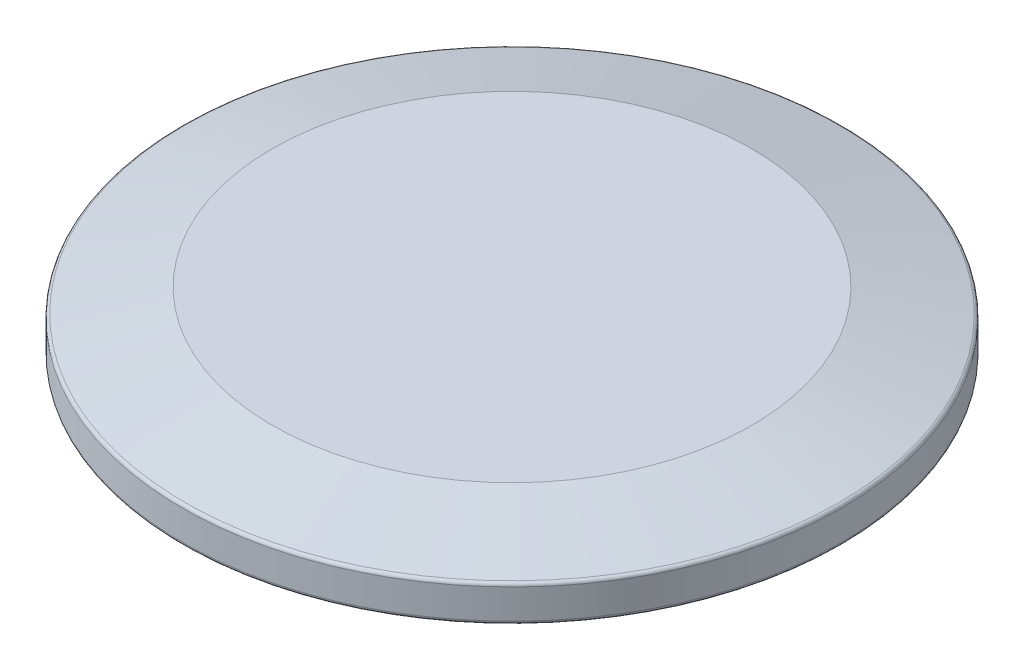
ISO-10303-21;
HEADER;
FILE_DESCRIPTION(('STEP AP214'),'2;1');
FILE_NAME('part.step','',(''),(''),'','','');
FILE_SCHEMA(('AUTOMOTIVE_DESIGN { 1 0 10303 214 1 1 1 1 }'));
ENDSEC;
DATA;
#1=APPLICATION_CONTEXT('core data for automotive mechanical design processes');
#2=APPLICATION_PROTOCOL_DEFINITION('international standard','automotive_design',2000,#1);
#3=PRODUCT_CONTEXT('',#1,'mechanical');
#4=PRODUCT('Part','Part','',(#3));
#5=PRODUCT_RELATED_PRODUCT_CATEGORY('part','',(#4));
#6=PRODUCT_DEFINITION_FORMATION('','',#4);
#7=PRODUCT_DEFINITION_CONTEXT('part definition',#1,'design');
#8=PRODUCT_DEFINITION('design','',#6,#7);
#9=PRODUCT_DEFINITION_SHAPE('','',#8);
#10=(LENGTH_UNIT() NAMED_UNIT(*) SI_UNIT(.MILLI.,.METRE.));
#11=(NAMED_UNIT(*) PLANE_ANGLE_UNIT() SI_UNIT($,.RADIAN.));
#12=(NAMED_UNIT(*) SI_UNIT($,.STERADIAN.) SOLID_ANGLE_UNIT());
#13=UNCERTAINTY_MEASURE_WITH_UNIT(LENGTH_MEASURE(1.E-05),#10,'distance_accuracy_value','');
#14=(GEOMETRIC_REPRESENTATION_CONTEXT(3) GLOBAL_UNCERTAINTY_ASSIGNED_CONTEXT((#13)) GLOBAL_UNIT_ASSIGNED_CONTEXT((#10,
#11,#12)) REPRESENTATION_CONTEXT('',''));
#15=CARTESIAN_POINT('',(0.,0.,0.));
#16=DIRECTION('',(0.,0.,1.));
#17=DIRECTION('',(1.,0.,0.));
#18=AXIS2_PLACEMENT_3D('',#15,#16,#17);
#19=CARTESIAN_POINT('',(0.,0.299999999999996,0.));
#20=DIRECTION('',(0.,1.,0.));
#21=DIRECTION('',(-1.,0.,0.));
#22=AXIS2_PLACEMENT_3D('',#19,#20,#21);
#23=TOROIDAL_SURFACE('',#22,21.,0.3);
#24=CARTESIAN_POINT('',(0.,0.,0.));
#25=DIRECTION('',(0.,1.,0.));
#26=DIRECTION('',(-1.,0.,0.));
#27=AXIS2_PLACEMENT_3D('',#24,#25,#26);
#28=CIRCLE('',#27,21.);
#29=CARTESIAN_POINT('',(-21.,0.,0.));
#30=VERTEX_POINT('',#29);
#31=EDGE_CURVE('E52',#30,#30,#28,.T.);
#32=ORIENTED_EDGE('',*,*,#31,.F.);
#33=EDGE_LOOP('',(#32));
#34=FACE_BOUND('',#33,.T.);
#35=CARTESIAN_POINT('',(0.,0.299999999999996,0.));
#36=DIRECTION('',(0.,1.,0.));
#37=DIRECTION('',(-1.,0.,0.));
#38=AXIS2_PLACEMENT_3D('',#35,#36,#37);
#39=CIRCLE('',#38,20.7);
#40=CARTESIAN_POINT('',(-20.7,0.299999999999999,0.));
#41=VERTEX_POINT('',#40);
#42=EDGE_CURVE('E10',#41,#41,#39,.F.);
#43=ORIENTED_EDGE('',*,*,#42,.F.);
#44=EDGE_LOOP('',(#43));
#45=FACE_BOUND('',#44,.T.);
#46=ADVANCED_FACE('F45',(#34,#45),#23,.T.);
#47=CARTESIAN_POINT('',(0.,0.299999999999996,0.));
#48=DIRECTION('',(0.,1.,0.));
#49=DIRECTION('',(-1.,0.,0.));
#50=AXIS2_PLACEMENT_3D('',#47,#48,#49);
#51=TOROIDAL_SURFACE('',#50,27.2,0.3);
#52=CARTESIAN_POINT('',(0.,0.299999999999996,0.));
#53=DIRECTION('',(0.,1.,0.));
#54=DIRECTION('',(-1.,0.,0.));
#55=AXIS2_PLACEMENT_3D('',#52,#53,#54);
#56=CIRCLE('',#55,27.5);
#57=CARTESIAN_POINT('',(-27.5,0.3,0.));
#58=VERTEX_POINT('',#57);
#59=EDGE_CURVE('E62',#58,#58,#56,.T.);
#60=ORIENTED_EDGE('',*,*,#59,.F.);
#61=EDGE_LOOP('',(#60));
#62=FACE_BOUND('',#61,.T.);
#63=CARTESIAN_POINT('',(0.,0.,0.));
#64=DIRECTION('',(0.,1.,0.));
#65=DIRECTION('',(-1.,0.,0.));
#66=AXIS2_PLACEMENT_3D('',#63,#64,#65);
#67=CIRCLE('',#66,27.2);
#68=CARTESIAN_POINT('',(-27.2,0.,0.));
#69=VERTEX_POINT('',#68);
#70=EDGE_CURVE('E57',#69,#69,#67,.F.);
#71=ORIENTED_EDGE('',*,*,#70,.F.);
#72=EDGE_LOOP('',(#71));
#73=FACE_BOUND('',#72,.T.);
#74=ADVANCED_FACE('F108',(#62,#73),#51,.T.);
#75=CARTESIAN_POINT('',(0.,2.76951650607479,0.));
#76=DIRECTION('',(0.,-1.,0.));
#77=DIRECTION('',(1.,0.,0.));
#78=AXIS2_PLACEMENT_3D('',#75,#76,#77);
#79=TOROIDAL_SURFACE('',#78,27.2,0.3);
#80=CARTESIAN_POINT('',(0.,3.05938698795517,0.));
#81=DIRECTION('',(0.,1.,0.));
#82=DIRECTION('',(-1.,0.,0.));
#83=AXIS2_PLACEMENT_3D('',#80,#81,#82);
#84=CIRCLE('',#83,27.2772987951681);
#85=CARTESIAN_POINT('',(-27.2772987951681,3.05938698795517,0.));
#86=VERTEX_POINT('',#85);
#87=EDGE_CURVE('E72',#86,#86,#84,.T.);
#88=ORIENTED_EDGE('',*,*,#87,.F.);
#89=EDGE_LOOP('',(#88));
#90=FACE_BOUND('',#89,.T.);
#91=CARTESIAN_POINT('',(0.,2.76951650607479,0.));
#92=DIRECTION('',(0.,-1.,0.));
#93=DIRECTION('',(1.,0.,0.));
#94=AXIS2_PLACEMENT_3D('',#91,#92,#93);
#95=CIRCLE('',#94,27.5);
#96=CARTESIAN_POINT('',(27.5,2.76951650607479,0.));
#97=VERTEX_POINT('',#96);
#98=EDGE_CURVE('E68',#97,#97,#95,.T.);
#99=ORIENTED_EDGE('',*,*,#98,.F.);
#100=EDGE_LOOP('',(#99));
#101=FACE_BOUND('',#100,.T.);
#102=ADVANCED_FACE('F98',(#90,#101),#79,.T.);
#103=CARTESIAN_POINT('',(0.,2.5,0.));
#104=DIRECTION('',(0.,-1.,0.));
#105=DIRECTION('',(1.,0.,0.));
#106=AXIS2_PLACEMENT_3D('',#103,#104,#105);
#107=PLANE('',#106);
#108=CARTESIAN_POINT('',(0.,2.5,0.));
#109=DIRECTION('',(0.,1.,0.));
#110=DIRECTION('',(-1.,0.,0.));
#111=AXIS2_PLACEMENT_3D('',#108,#109,#110);
#112=CIRCLE('',#111,17.5);
#113=CARTESIAN_POINT('',(-17.5,2.5,0.));
#114=VERTEX_POINT('',#113);
#115=EDGE_CURVE('E76',#114,#114,#112,.T.);
#116=ORIENTED_EDGE('',*,*,#115,.T.);
#117=EDGE_LOOP('',(#116));
#118=FACE_BOUND('',#117,.T.);
#119=CARTESIAN_POINT('',(0.,2.5,0.));
#120=DIRECTION('',(0.,1.,0.));
#121=DIRECTION('',(-1.,0.,0.));
#122=AXIS2_PLACEMENT_3D('',#119,#120,#121);
#123=CIRCLE('',#122,20.7);
#124=CARTESIAN_POINT('',(-20.7,2.5,0.));
#125=VERTEX_POINT('',#124);
#126=EDGE_CURVE('E88',#125,#125,#123,.T.);
#127=ORIENTED_EDGE('',*,*,#126,.F.);
#128=EDGE_LOOP('',(#127));
#129=FACE_BOUND('',#128,.T.);
#130=ADVANCED_FACE('F95',(#118,#129),#107,.T.);
#131=CARTESIAN_POINT('',(0.,5.,0.));
#132=DIRECTION('',(0.,1.,0.));
#133=DIRECTION('',(-1.,0.,0.));
#134=AXIS2_PLACEMENT_3D('',#131,#132,#133);
#135=CYLINDRICAL_SURFACE('',#134,17.5);
#136=CARTESIAN_POINT('',(0.,0.,0.));
#137=DIRECTION('',(0.,1.,0.));
#138=DIRECTION('',(-1.,0.,0.));
#139=AXIS2_PLACEMENT_3D('',#136,#137,#138);
#140=CIRCLE('',#139,17.5);
#141=CARTESIAN_POINT('',(-17.5,0.,0.));
#142=VERTEX_POINT('',#141);
#143=EDGE_CURVE('E80',#142,#142,#140,.T.);
#144=ORIENTED_EDGE('',*,*,#143,.T.);
#145=EDGE_LOOP('',(#144));
#146=FACE_BOUND('',#145,.T.);
#147=ORIENTED_EDGE('',*,*,#115,.F.);
#148=EDGE_LOOP('',(#147));
#149=FACE_BOUND('',#148,.T.);
#150=ADVANCED_FACE('F97',(#146,#149),#135,.T.);
#151=CARTESIAN_POINT('',(0.,0.,0.));
#152=DIRECTION('',(0.,1.,0.));
#153=DIRECTION('',(-1.,0.,0.));
#154=AXIS2_PLACEMENT_3D('',#151,#152,#153);
#155=PLANE('',#154);
#156=ORIENTED_EDGE('',*,*,#143,.F.);
#157=EDGE_LOOP('',(#156));
#158=FACE_BOUND('',#157,.T.);
#159=ADVANCED_FACE('F104',(#158),#155,.F.);
#160=CARTESIAN_POINT('',(0.,5.,0.));
#161=DIRECTION('',(0.,-1.,0.));
#162=DIRECTION('',(1.,0.,0.));
#163=AXIS2_PLACEMENT_3D('',#160,#161,#162);
#164=PLANE('',#163);
#165=CARTESIAN_POINT('',(0.,5.,0.));
#166=DIRECTION('',(0.,1.,0.));
#167=DIRECTION('',(-1.,0.,0.));
#168=AXIS2_PLACEMENT_3D('',#165,#166,#167);
#169=CIRCLE('',#168,20.);
#170=CARTESIAN_POINT('',(-20.,5.,0.));
#171=VERTEX_POINT('',#170);
#172=EDGE_CURVE('E84',#171,#171,#169,.T.);
#173=ORIENTED_EDGE('',*,*,#172,.T.);
#174=EDGE_LOOP('',(#173));
#175=FACE_BOUND('',#174,.T.);
#176=ADVANCED_FACE('F139',(#175),#164,.F.);
#177=CARTESIAN_POINT('',(0.,2.99999999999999,0.));
#178=DIRECTION('',(0.,-1.,0.));
#179=DIRECTION('',(1.,0.,0.));
#180=AXIS2_PLACEMENT_3D('',#177,#178,#179);
#181=CONICAL_SURFACE('',#180,27.5,1.31019393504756);
#182=ORIENTED_EDGE('',*,*,#87,.T.);
#183=EDGE_LOOP('',(#182));
#184=FACE_BOUND('',#183,.T.);
#185=ORIENTED_EDGE('',*,*,#172,.F.);
#186=EDGE_LOOP('',(#185));
#187=FACE_BOUND('',#186,.T.);
#188=ADVANCED_FACE('F134',(#184,#187),#181,.T.);
#189=CARTESIAN_POINT('',(0.,5.,0.));
#190=DIRECTION('',(0.,1.,0.));
#191=DIRECTION('',(-1.,0.,0.));
#192=AXIS2_PLACEMENT_3D('',#189,#190,#191);
#193=CYLINDRICAL_SURFACE('',#192,27.5);
#194=ORIENTED_EDGE('',*,*,#59,.T.);
#195=EDGE_LOOP('',(#194));
#196=FACE_BOUND('',#195,.T.);
#197=ORIENTED_EDGE('',*,*,#98,.T.);
#198=EDGE_LOOP('',(#197));
#199=FACE_BOUND('',#198,.T.);
#200=ADVANCED_FACE('F128',(#196,#199),#193,.T.);
#201=CARTESIAN_POINT('',(0.,0.,0.));
#202=DIRECTION('',(0.,1.,0.));
#203=DIRECTION('',(-1.,0.,0.));
#204=AXIS2_PLACEMENT_3D('',#201,#202,#203);
#205=PLANE('',#204);
#206=ORIENTED_EDGE('',*,*,#31,.T.);
#207=EDGE_LOOP('',(#206));
#208=FACE_BOUND('',#207,.T.);
#209=ORIENTED_EDGE('',*,*,#70,.T.);
#210=EDGE_LOOP('',(#209));
#211=FACE_BOUND('',#210,.T.);
#212=ADVANCED_FACE('F127',(#208,#211),#205,.F.);
#213=CARTESIAN_POINT('',(0.,5.,0.));
#214=DIRECTION('',(0.,1.,0.));
#215=DIRECTION('',(-1.,0.,0.));
#216=AXIS2_PLACEMENT_3D('',#213,#214,#215);
#217=CYLINDRICAL_SURFACE('',#216,20.7);
#218=ORIENTED_EDGE('',*,*,#42,.T.);
#219=EDGE_LOOP('',(#218));
#220=FACE_BOUND('',#219,.T.);
#221=ORIENTED_EDGE('',*,*,#126,.T.);
#222=EDGE_LOOP('',(#221));
#223=FACE_BOUND('',#222,.T.);
#224=ADVANCED_FACE('F93',(#220,#223),#217,.F.);
#225=CLOSED_SHELL('',(#46,#74,#102,#130,#150,#159,#176,#188,#200,#212,#224));
#226=MANIFOLD_SOLID_BREP('B2',#225);
#227=ADVANCED_BREP_SHAPE_REPRESENTATION('',(#18,#226),#14);
#228=SHAPE_DEFINITION_REPRESENTATION(#9,#227);
ENDSEC;
END-ISO-10303-21;
